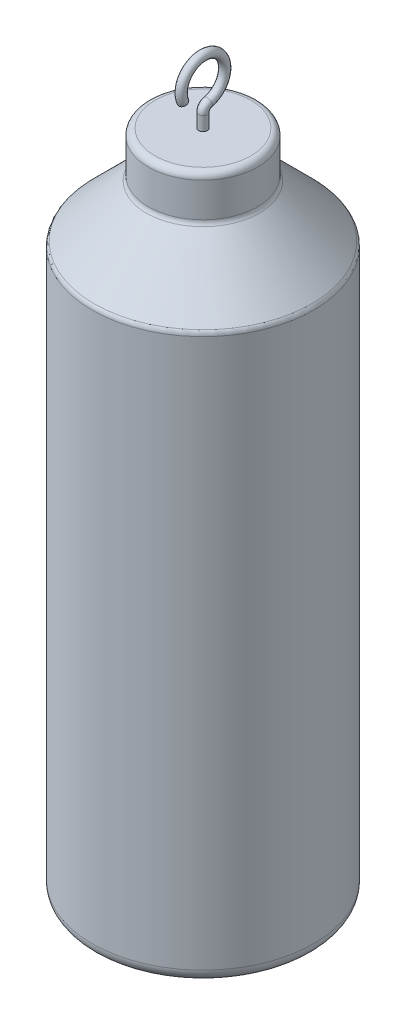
ISO-10303-21;
HEADER;
FILE_DESCRIPTION(('STEP AP214'),'2;1');
FILE_NAME('part.step','',(''),(''),'','','');
FILE_SCHEMA(('AUTOMOTIVE_DESIGN { 1 0 10303 214 1 1 1 1 }'));
ENDSEC;
DATA;
#1=APPLICATION_CONTEXT('core data for automotive mechanical design processes');
#2=APPLICATION_PROTOCOL_DEFINITION('international standard','automotive_design',2000,#1);
#3=PRODUCT_CONTEXT('',#1,'mechanical');
#4=PRODUCT('Part','Part','',(#3));
#5=PRODUCT_RELATED_PRODUCT_CATEGORY('part','',(#4));
#6=PRODUCT_DEFINITION_FORMATION('','',#4);
#7=PRODUCT_DEFINITION_CONTEXT('part definition',#1,'design');
#8=PRODUCT_DEFINITION('design','',#6,#7);
#9=PRODUCT_DEFINITION_SHAPE('','',#8);
#10=(LENGTH_UNIT() NAMED_UNIT(*) SI_UNIT(.MILLI.,.METRE.));
#11=(NAMED_UNIT(*) PLANE_ANGLE_UNIT() SI_UNIT($,.RADIAN.));
#12=(NAMED_UNIT(*) SI_UNIT($,.STERADIAN.) SOLID_ANGLE_UNIT());
#13=UNCERTAINTY_MEASURE_WITH_UNIT(LENGTH_MEASURE(1.E-05),#10,'distance_accuracy_value','');
#14=(GEOMETRIC_REPRESENTATION_CONTEXT(3) GLOBAL_UNCERTAINTY_ASSIGNED_CONTEXT((#13)) GLOBAL_UNIT_ASSIGNED_CONTEXT((#10,
#11,#12)) REPRESENTATION_CONTEXT('',''));
#15=CARTESIAN_POINT('',(0.,0.,0.));
#16=DIRECTION('',(0.,0.,1.));
#17=DIRECTION('',(1.,0.,0.));
#18=AXIS2_PLACEMENT_3D('',#15,#16,#17);
#19=CARTESIAN_POINT('',(0.,161.9,0.));
#20=DIRECTION('',(1.,0.,0.));
#21=DIRECTION('',(0.,0.,-1.));
#22=AXIS2_PLACEMENT_3D('',#19,#20,#21);
#23=TOROIDAL_SURFACE('',#22,5.00000000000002,1.);
#24=CARTESIAN_POINT('',(0.,160.349359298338,3.6872094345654));
#25=CARTESIAN_POINT('',(0.53458281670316,160.349461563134,3.68698649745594));
#26=CARTESIAN_POINT('',(1.00013574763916,160.15570760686,4.11026851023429));
#27=CARTESIAN_POINT('',(0.999863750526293,159.708631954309,5.08115373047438));
#28=CARTESIAN_POINT('',(0.535620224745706,159.513014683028,5.50443066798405));
#29=CARTESIAN_POINT('',(-0.536340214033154,159.51276723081,5.5049670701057));
#30=CARTESIAN_POINT('',(-1.00014296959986,159.70830748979,5.08185716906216));
#31=CARTESIAN_POINT('',(-0.999857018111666,160.155346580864,4.11105395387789));
#32=CARTESIAN_POINT('',(-0.534582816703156,160.349257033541,3.68743237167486));
#33=CARTESIAN_POINT('',(0.,160.349359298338,3.6872094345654));
#34=B_SPLINE_CURVE_WITH_KNOTS('',3,(#24,#25,#26,#27,#28,#29,#30,#31,#32,#33),.UNSPECIFIED.,.T.,
.F.,(4,2,2,2,4),(8.83731340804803E-05,0.00141256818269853,0.00273676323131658,
0.00406095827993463,0.00538515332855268),.UNSPECIFIED.);
#35=CARTESIAN_POINT('',(0.,160.349359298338,3.6872094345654));
#36=VERTEX_POINT('',#35);
#37=EDGE_CURVE('E11',#36,#36,#34,.F.);
#38=ORIENTED_EDGE('',*,*,#37,.T.);
#39=EDGE_LOOP('',(#38));
#40=FACE_BOUND('',#39,.T.);
#41=CARTESIAN_POINT('',(0.,157.034957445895,-1.15384615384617));
#42=DIRECTION('',(0.,0.230769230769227,-0.973008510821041));
#43=DIRECTION('',(0.,0.973008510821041,0.230769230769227));
#44=AXIS2_PLACEMENT_3D('',#41,#42,#43);
#45=CIRCLE('',#44,1.);
#46=CARTESIAN_POINT('',(0.,158.007965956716,-0.923076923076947));
#47=VERTEX_POINT('',#46);
#48=EDGE_CURVE('E68',#47,#47,#45,.T.);
#49=ORIENTED_EDGE('',*,*,#48,.T.);
#50=EDGE_LOOP('',(#49));
#51=FACE_BOUND('',#50,.T.);
#52=ADVANCED_FACE('F41',(#40,#51),#23,.T.);
#53=CARTESIAN_POINT('',(0.,155.575444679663,-1.5));
#54=DIRECTION('',(-1.,0.,0.));
#55=DIRECTION('',(0.,0.,1.));
#56=AXIS2_PLACEMENT_3D('',#53,#54,#55);
#57=TOROIDAL_SURFACE('',#56,1.5,1.);
#58=CARTESIAN_POINT('',(0.,155.575444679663,0.));
#59=DIRECTION('',(0.,1.,0.));
#60=DIRECTION('',(0.,0.,1.));
#61=AXIS2_PLACEMENT_3D('',#58,#59,#60);
#62=CIRCLE('',#61,1.);
#63=CARTESIAN_POINT('',(0.,155.575444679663,1.));
#64=VERTEX_POINT('',#63);
#65=EDGE_CURVE('E129',#64,#64,#62,.T.);
#66=CARTESIAN_POINT('',(0.,155.575444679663,-1.5));
#67=DIRECTION('',(-1.,0.,0.));
#68=DIRECTION('',(0.,0.,1.));
#69=AXIS2_PLACEMENT_3D('',#66,#67,#68);
#70=CIRCLE('',#69,2.5);
#71=EDGE_CURVE('',#64,#47,#70,.T.);
#72=ORIENTED_EDGE('',*,*,#65,.T.);
#73=ORIENTED_EDGE('',*,*,#48,.F.);
#74=ORIENTED_EDGE('',*,*,#71,.T.);
#75=ORIENTED_EDGE('',*,*,#71,.F.);
#76=EDGE_LOOP('',(#72,#74,#73,#75));
#77=FACE_BOUND('',#76,.T.);
#78=ADVANCED_FACE('F92',(#77),#57,.T.);
#79=CARTESIAN_POINT('',(0.,155.575444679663,0.));
#80=DIRECTION('',(0.,-1.,0.));
#81=DIRECTION('',(0.,0.,-1.));
#82=AXIS2_PLACEMENT_3D('',#79,#80,#81);
#83=CYLINDRICAL_SURFACE('',#82,1.);
#84=CARTESIAN_POINT('',(0.,122.55,0.));
#85=DIRECTION('',(0.,1.,0.));
#86=DIRECTION('',(0.,0.,1.));
#87=AXIS2_PLACEMENT_3D('',#84,#85,#86);
#88=CIRCLE('',#87,1.);
#89=CARTESIAN_POINT('',(0.,122.55,1.));
#90=VERTEX_POINT('',#89);
#91=EDGE_CURVE('E63',#90,#90,#88,.T.);
#92=ORIENTED_EDGE('',*,*,#91,.T.);
#93=EDGE_LOOP('',(#92));
#94=FACE_BOUND('',#93,.T.);
#95=ORIENTED_EDGE('',*,*,#65,.F.);
#96=EDGE_LOOP('',(#95));
#97=FACE_BOUND('',#96,.T.);
#98=ADVANCED_FACE('F86',(#94,#97),#83,.T.);
#99=CARTESIAN_POINT('',(0.,159.786908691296,4.53153893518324));
#100=DIRECTION('',(0.,-0.906307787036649,-0.422618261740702));
#101=DIRECTION('',(0.,0.422618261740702,-0.906307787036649));
#102=AXIS2_PLACEMENT_3D('',#99,#100,#101);
#103=PLANE('',#102);
#104=CARTESIAN_POINT('',(0.,160.146134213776,3.76117731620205));
#105=CARTESIAN_POINT('',(-0.0140956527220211,160.146131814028,3.76118246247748));
#106=CARTESIAN_POINT('',(-0.028190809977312,160.145967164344,3.761535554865));
#107=CARTESIAN_POINT('',(-0.0562455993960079,160.145318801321,3.76292597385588));
#108=CARTESIAN_POINT('',(-0.0702055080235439,160.144837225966,3.76395871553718));
#109=CARTESIAN_POINT('',(-0.0979689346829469,160.143563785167,3.76668961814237));
#110=CARTESIAN_POINT('',(-0.11177289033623,160.142773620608,3.76838413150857));
#111=CARTESIAN_POINT('',(-0.139203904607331,160.140892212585,3.77241882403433));
#112=CARTESIAN_POINT('',(-0.152831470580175,160.139802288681,3.7747561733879));
#113=CARTESIAN_POINT('',(-0.179889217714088,160.137330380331,3.78005719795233));
#114=CARTESIAN_POINT('',(-0.193319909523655,160.135949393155,3.78301873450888));
#115=CARTESIAN_POINT('',(-0.219963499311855,160.132904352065,3.78954884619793));
#116=CARTESIAN_POINT('',(-0.233176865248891,160.131241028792,3.79311585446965));
#117=CARTESIAN_POINT('',(-0.259365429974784,160.127640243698,3.80083776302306));
#118=CARTESIAN_POINT('',(-0.272341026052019,160.125703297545,3.80499155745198));
#119=CARTESIAN_POINT('',(-0.298033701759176,160.121564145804,3.81386799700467));
#120=CARTESIAN_POINT('',(-0.310751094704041,160.119362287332,3.81858989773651));
#121=CARTESIAN_POINT('',(-0.335907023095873,160.114702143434,3.82858360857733));
#122=CARTESIAN_POINT('',(-0.34834578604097,160.112244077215,3.8338549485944));
#123=CARTESIAN_POINT('',(-0.372924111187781,160.107080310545,3.84492868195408));
#124=CARTESIAN_POINT('',(-0.385063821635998,160.104374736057,3.85073080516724));
#125=CARTESIAN_POINT('',(-0.409023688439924,160.098724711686,3.86284732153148));
#126=CARTESIAN_POINT('',(-0.420843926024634,160.0957803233,3.86916158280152));
#127=CARTESIAN_POINT('',(-0.444144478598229,160.089661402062,3.88228365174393));
#128=CARTESIAN_POINT('',(-0.45562482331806,160.086486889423,3.88909141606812));
#129=CARTESIAN_POINT('',(-0.478225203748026,160.079916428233,3.9031818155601));
#130=CARTESIAN_POINT('',(-0.489345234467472,160.076520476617,3.91046445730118));
#131=CARTESIAN_POINT('',(-0.511204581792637,160.069515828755,3.92548597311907));
#132=CARTESIAN_POINT('',(-0.521943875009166,160.065907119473,3.93322487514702));
#133=CARTESIAN_POINT('',(-0.543021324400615,160.058485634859,3.94914030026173));
#134=CARTESIAN_POINT('',(-0.553359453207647,160.054672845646,3.9573168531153));
#135=CARTESIAN_POINT('',(-0.573614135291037,160.046851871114,3.97408898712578));
#136=CARTESIAN_POINT('',(-0.583530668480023,160.042843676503,3.9826845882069));
#137=CARTESIAN_POINT('',(-0.602921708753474,160.034640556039,4.00027623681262));
#138=CARTESIAN_POINT('',(-0.612396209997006,160.030445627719,4.00927228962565));
#139=CARTESIAN_POINT('',(-0.63088272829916,160.021877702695,4.02764626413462));
#140=CARTESIAN_POINT('',(-0.639894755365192,160.017504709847,4.03702417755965));
#141=CARTESIAN_POINT('',(-0.657435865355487,160.008589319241,4.05614329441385));
#142=CARTESIAN_POINT('',(-0.665964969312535,160.004046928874,4.06588448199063));
#143=CARTESIAN_POINT('',(-0.682519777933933,159.994801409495,4.0857115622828));
#144=CARTESIAN_POINT('',(-0.690545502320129,159.990098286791,4.09579744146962));
#145=CARTESIAN_POINT('',(-0.706073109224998,159.980539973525,4.11629531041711));
#146=CARTESIAN_POINT('',(-0.713574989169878,159.975684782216,4.1267073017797));
#147=CARTESIAN_POINT('',(-0.728034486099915,159.965831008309,4.1478387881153));
#148=CARTESIAN_POINT('',(-0.734992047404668,159.960832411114,4.15855831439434));
#149=CARTESIAN_POINT('',(-0.74834251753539,159.950700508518,4.18028624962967));
#150=CARTESIAN_POINT('',(-0.754735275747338,159.945567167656,4.19129473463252));
#151=CARTESIAN_POINT('',(-0.766935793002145,159.935174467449,4.21358195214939));
#152=CARTESIAN_POINT('',(-0.772743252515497,159.929915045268,4.2248608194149));
#153=CARTESIAN_POINT('',(-0.78375288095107,159.919278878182,4.2476701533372));
#154=CARTESIAN_POINT('',(-0.788954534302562,159.913902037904,4.25920082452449));
#155=CARTESIAN_POINT('',(-0.798732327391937,159.903039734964,4.28249510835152));
#156=CARTESIAN_POINT('',(-0.803307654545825,159.89755414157,4.29425900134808));
#157=CARTESIAN_POINT('',(-0.811812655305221,159.886483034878,4.31800106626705));
#158=CARTESIAN_POINT('',(-0.815741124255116,159.88089735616,4.32997959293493));
#159=CARTESIAN_POINT('',(-0.822932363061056,159.869634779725,4.35413226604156));
#160=CARTESIAN_POINT('',(-0.826193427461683,159.863957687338,4.36630682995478));
#161=CARTESIAN_POINT('',(-0.832029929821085,159.852520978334,4.39083293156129));
#162=CARTESIAN_POINT('',(-0.834603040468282,159.846761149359,4.40318492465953));
#163=CARTESIAN_POINT('',(-0.839043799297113,159.835167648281,4.42804726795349));
#164=CARTESIAN_POINT('',(-0.840908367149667,159.829333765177,4.44055807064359));
#165=CARTESIAN_POINT('',(-0.843912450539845,159.817600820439,4.46571945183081));
#166=CARTESIAN_POINT('',(-0.845047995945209,159.811701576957,4.47837042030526));
#167=CARTESIAN_POINT('',(-0.846574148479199,159.799846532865,4.50379364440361));
#168=CARTESIAN_POINT('',(-0.846959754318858,159.79389061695,4.51656614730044));
#169=CARTESIAN_POINT('',(-0.846967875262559,159.781978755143,4.54211121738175));
#170=CARTESIAN_POINT('',(-0.846590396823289,159.776022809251,4.55488378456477));
#171=CARTESIAN_POINT('',(-0.845082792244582,159.764167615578,4.58030732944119));
#172=CARTESIAN_POINT('',(-0.843957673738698,159.758268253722,4.59295855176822));
#173=CARTESIAN_POINT('',(-0.840975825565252,159.746535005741,4.61812058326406));
#174=CARTESIAN_POINT('',(-0.839123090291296,159.740700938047,4.63063178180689));
#175=CARTESIAN_POINT('',(-0.834707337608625,159.729107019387,4.65549502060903));
#176=CARTESIAN_POINT('',(-0.832147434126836,159.723346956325,4.66784751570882));
#177=CARTESIAN_POINT('',(-0.826338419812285,159.711909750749,4.69237468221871));
#178=CARTESIAN_POINT('',(-0.823091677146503,159.706232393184,4.70454981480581));
#179=CARTESIAN_POINT('',(-0.815929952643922,159.694969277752,4.72870364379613));
#180=CARTESIAN_POINT('',(-0.812016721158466,159.689383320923,4.74068276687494));
#181=CARTESIAN_POINT('',(-0.803542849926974,159.678311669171,4.76442600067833));
#182=CARTESIAN_POINT('',(-0.798983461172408,159.672825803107,4.77619047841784));
#183=CARTESIAN_POINT('',(-0.789237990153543,159.661962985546,4.79948586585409));
#184=CARTESIAN_POINT('',(-0.784052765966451,159.656585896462,4.81101707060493));
#185=CARTESIAN_POINT('',(-0.773076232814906,159.645949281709,4.83382736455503));
#186=CARTESIAN_POINT('',(-0.767285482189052,159.640689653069,4.84510667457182));
#187=CARTESIAN_POINT('',(-0.755118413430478,159.630296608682,4.86739463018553));
#188=CARTESIAN_POINT('',(-0.748742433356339,159.625163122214,4.87840342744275));
#189=CARTESIAN_POINT('',(-0.73542534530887,159.615031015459,4.90013180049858));
#190=CARTESIAN_POINT('',(-0.728484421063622,159.610032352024,4.91085146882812));
#191=CARTESIAN_POINT('',(-0.714057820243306,159.600178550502,4.93198301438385));
#192=CARTESIAN_POINT('',(-0.706572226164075,159.595323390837,4.94239493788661));
#193=CARTESIAN_POINT('',(-0.691076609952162,159.585765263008,4.96289240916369));
#194=CARTESIAN_POINT('',(-0.683066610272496,159.581062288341,4.97297797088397));
#195=CARTESIAN_POINT('',(-0.666542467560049,159.57181720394,4.99280411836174));
#196=CARTESIAN_POINT('',(-0.65802831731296,159.56727509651,5.00254469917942));
#197=CARTESIAN_POINT('',(-0.640516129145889,159.558360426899,5.02166226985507));
#198=CARTESIAN_POINT('',(-0.631518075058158,159.553987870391,5.03103924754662));
#199=CARTESIAN_POINT('',(-0.613058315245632,159.545420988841,5.04941098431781));
#200=CARTESIAN_POINT('',(-0.603596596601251,159.541226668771,5.05840573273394));
#201=CARTESIAN_POINT('',(-0.584229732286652,159.533024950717,5.0759943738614));
#202=CARTESIAN_POINT('',(-0.574324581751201,159.529017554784,5.08458826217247));
#203=CARTESIAN_POINT('',(-0.554091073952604,159.521198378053,5.10135654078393));
#204=CARTESIAN_POINT('',(-0.543762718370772,159.517386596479,5.10953093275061));
#205=CARTESIAN_POINT('',(-0.522703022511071,159.50996734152,5.12544157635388));
#206=CARTESIAN_POINT('',(-0.511971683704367,159.506359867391,5.1331778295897));
#207=CARTESIAN_POINT('',(-0.490126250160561,159.499357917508,5.14819355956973));
#208=CARTESIAN_POINT('',(-0.479012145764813,159.495963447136,5.15547302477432));
#209=CARTESIAN_POINT('',(-0.456421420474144,159.489396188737,5.16955655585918));
#210=CARTESIAN_POINT('',(-0.444944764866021,159.486223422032,5.17636057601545));
#211=CARTESIAN_POINT('',(-0.421649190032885,159.480108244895,5.189474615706));
#212=CARTESIAN_POINT('',(-0.409830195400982,159.477165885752,5.19578452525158));
#213=CARTESIAN_POINT('',(-0.385870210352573,159.471520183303,5.20789177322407));
#214=CARTESIAN_POINT('',(-0.373729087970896,159.468816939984,5.21368889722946));
#215=CARTESIAN_POINT('',(-0.349145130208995,159.463658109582,5.22475204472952));
#216=CARTESIAN_POINT('',(-0.336702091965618,159.461202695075,5.23001769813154));
#217=CARTESIAN_POINT('',(-0.311534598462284,159.456548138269,5.23999942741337));
#218=CARTESIAN_POINT('',(-0.298809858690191,159.454349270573,5.24471491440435));
#219=CARTESIAN_POINT('',(-0.273099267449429,159.450216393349,5.25357789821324));
#220=CARTESIAN_POINT('',(-0.260113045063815,159.448282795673,5.25772451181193));
#221=CARTESIAN_POINT('',(-0.233899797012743,159.444689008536,5.26543141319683));
#222=CARTESIAN_POINT('',(-0.220672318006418,159.443029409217,5.26899043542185));
#223=CARTESIAN_POINT('',(-0.193996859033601,159.439992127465,5.27550390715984));
#224=CARTESIAN_POINT('',(-0.180548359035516,159.438615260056,5.27845660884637));
#225=CARTESIAN_POINT('',(-0.153451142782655,159.436151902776,5.28373929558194));
#226=CARTESIAN_POINT('',(-0.139801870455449,159.435066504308,5.28606694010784));
#227=CARTESIAN_POINT('',(-0.112323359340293,159.433194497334,5.29008147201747));
#228=CARTESIAN_POINT('',(-0.0984935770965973,159.432409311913,5.29176530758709));
#229=CARTESIAN_POINT('',(-0.0706742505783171,159.431146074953,5.29447432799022));
#230=CARTESIAN_POINT('',(-0.0566842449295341,159.430669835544,5.29549562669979));
#231=CARTESIAN_POINT('',(-0.0285645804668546,159.430032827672,5.29686169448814));
#232=CARTESIAN_POINT('',(-0.0144346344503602,159.429874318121,5.29720161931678));
#233=CARTESIAN_POINT('',(0.0138256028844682,159.429880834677,5.29718764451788));
#234=CARTESIAN_POINT('',(0.0279558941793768,159.430045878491,5.29683370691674));
#235=CARTESIAN_POINT('',(0.056076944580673,159.430695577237,5.29544042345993));
#236=CARTESIAN_POINT('',(0.0700679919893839,159.431178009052,5.29440584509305));
#237=CARTESIAN_POINT('',(0.0978900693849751,159.432453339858,5.29167088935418));
#238=CARTESIAN_POINT('',(0.111721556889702,159.433244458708,5.28997432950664));
#239=CARTESIAN_POINT('',(0.139204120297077,159.435128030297,5.2859349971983));
#240=CARTESIAN_POINT('',(0.152855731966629,159.436219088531,5.28359521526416));
#241=CARTESIAN_POINT('',(0.179958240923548,159.438693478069,5.27828886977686));
#242=CARTESIAN_POINT('',(0.193409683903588,159.440075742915,5.27532459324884));
#243=CARTESIAN_POINT('',(0.22009161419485,159.443123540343,5.26878857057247));
#244=CARTESIAN_POINT('',(0.233322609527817,159.444788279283,5.26521852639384));
#245=CARTESIAN_POINT('',(0.259543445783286,159.448392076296,5.25749015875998));
#246=CARTESIAN_POINT('',(0.272533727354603,159.450330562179,5.25333306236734));
#247=CARTESIAN_POINT('',(0.298252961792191,159.454472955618,5.24444967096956));
#248=CARTESIAN_POINT('',(0.310982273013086,159.456676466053,5.2397242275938));
#249=CARTESIAN_POINT('',(0.336159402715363,159.461340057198,5.2297231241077));
#250=CARTESIAN_POINT('',(0.348607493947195,159.463799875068,5.22444802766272));
#251=CARTESIAN_POINT('',(0.373202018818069,159.468967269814,5.21336651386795));
#252=CARTESIAN_POINT('',(0.385348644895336,159.471674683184,5.20756044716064));
#253=CARTESIAN_POINT('',(0.409320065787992,159.477328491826,5.19543581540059));
#254=CARTESIAN_POINT('',(0.421144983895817,159.480274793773,5.18911745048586));
#255=CARTESIAN_POINT('',(0.444452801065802,159.486397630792,5.17598698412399));
#256=CARTESIAN_POINT('',(0.455935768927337,159.489574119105,5.16917498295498));
#257=CARTESIAN_POINT('',(0.478539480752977,159.4961486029,5.1550759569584));
#258=CARTESIAN_POINT('',(0.489660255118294,159.499546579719,5.14778897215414));
#259=CARTESIAN_POINT('',(0.51151935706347,159.50655533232,5.13275865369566));
#260=CARTESIAN_POINT('',(0.522257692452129,159.510166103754,5.12501532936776));
#261=CARTESIAN_POINT('',(0.543331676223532,159.517591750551,5.10909097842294));
#262=CARTESIAN_POINT('',(0.553667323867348,159.521406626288,5.1009099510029));
#263=CARTESIAN_POINT('',(0.573915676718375,159.52923179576,5.08412882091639));
#264=CARTESIAN_POINT('',(0.583828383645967,159.533242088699,5.07552871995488));
#265=CARTESIAN_POINT('',(0.603210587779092,159.541449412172,5.05792805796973));
#266=CARTESIAN_POINT('',(0.612680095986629,159.545646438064,5.04892750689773));
#267=CARTESIAN_POINT('',(0.631155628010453,159.554218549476,5.03054455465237));
#268=CARTESIAN_POINT('',(0.640161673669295,159.558593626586,5.02116217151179));
#269=CARTESIAN_POINT('',(0.657690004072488,159.567513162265,5.00203416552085));
#270=CARTESIAN_POINT('',(0.666212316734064,159.572057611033,4.99228856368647));
#271=CARTESIAN_POINT('',(0.682752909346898,159.581307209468,4.97245273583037));
#272=CARTESIAN_POINT('',(0.690771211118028,159.586012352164,4.96236252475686));
#273=CARTESIAN_POINT('',(0.706283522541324,159.595574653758,4.9418561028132));
#274=CARTESIAN_POINT('',(0.713777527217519,159.600431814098,4.9314398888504));
#275=CARTESIAN_POINT('',(0.728221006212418,159.61028946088,4.91030009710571));
#276=CARTESIAN_POINT('',(0.735170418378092,159.615289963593,4.89957648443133));
#277=CARTESIAN_POINT('',(0.748504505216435,159.62542559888,4.87784054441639));
#278=CARTESIAN_POINT('',(0.754889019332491,159.630560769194,4.86682813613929));
#279=CARTESIAN_POINT('',(0.767073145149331,159.640957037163,4.84453326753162));
#280=CARTESIAN_POINT('',(0.772872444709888,159.646218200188,4.83325066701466));
#281=CARTESIAN_POINT('',(0.783866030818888,159.656857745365,4.81043408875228));
#282=CARTESIAN_POINT('',(0.789059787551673,159.662236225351,4.79889990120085));
#283=CARTESIAN_POINT('',(0.798822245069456,159.673101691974,4.77559883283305));
#284=CARTESIAN_POINT('',(0.803390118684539,159.678588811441,4.76383166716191));
#285=CARTESIAN_POINT('',(0.811880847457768,159.689662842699,4.74008333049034));
#286=CARTESIAN_POINT('',(0.815802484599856,159.695249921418,4.72810180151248));
#287=CARTESIAN_POINT('',(0.822980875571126,159.706515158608,4.70394342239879));
#288=CARTESIAN_POINT('',(0.826235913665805,159.712193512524,4.69176615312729));
#289=CARTESIAN_POINT('',(0.832061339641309,159.723632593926,4.66723496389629));
#290=CARTESIAN_POINT('',(0.834629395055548,159.729393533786,4.65488058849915));
#291=CARTESIAN_POINT('',(0.839061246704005,159.740989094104,4.63001382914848));
#292=CARTESIAN_POINT('',(0.840921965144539,159.746823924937,4.61750099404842));
#293=CARTESIAN_POINT('',(0.843919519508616,159.758558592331,4.59233591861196));
#294=CARTESIAN_POINT('',(0.845052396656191,159.764458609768,4.57968329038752));
#295=CARTESIAN_POINT('',(0.846575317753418,159.776315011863,4.55425715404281));
#296=CARTESIAN_POINT('',(0.846960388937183,159.782271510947,4.54148340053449));
#297=CARTESIAN_POINT('',(0.84696682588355,159.794184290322,4.51593636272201));
#298=CARTESIAN_POINT('',(0.846588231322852,159.800140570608,4.50316307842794));
#299=CARTESIAN_POINT('',(0.845075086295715,159.811996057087,4.47773890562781));
#300=CARTESIAN_POINT('',(0.843945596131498,159.81789537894,4.465087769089));
#301=CARTESIAN_POINT('',(0.840952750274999,159.82962819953,4.43992665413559));
#302=CARTESIAN_POINT('',(0.839093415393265,159.835461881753,4.42741628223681));
#303=CARTESIAN_POINT('',(0.834662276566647,159.847054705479,4.40255539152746));
#304=CARTESIAN_POINT('',(0.832093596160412,159.85281406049,4.39020441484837));
#305=CARTESIAN_POINT('',(0.826265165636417,159.864249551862,4.36568092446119));
#306=CARTESIAN_POINT('',(0.823007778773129,159.869925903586,4.35350794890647));
#307=CARTESIAN_POINT('',(0.815823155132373,159.881186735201,4.32935901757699));
#308=CARTESIAN_POINT('',(0.811897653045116,159.886771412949,4.31738263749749));
#309=CARTESIAN_POINT('',(0.803397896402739,159.897840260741,4.29364541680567));
#310=CARTESIAN_POINT('',(0.798824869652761,159.903324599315,4.28188421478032));
#311=CARTESIAN_POINT('',(0.789051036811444,159.914184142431,4.25859584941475));
#312=CARTESIAN_POINT('',(0.783851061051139,159.919559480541,4.24706839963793));
#313=CARTESIAN_POINT('',(0.772844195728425,159.930192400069,4.22426603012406));
#314=CARTESIAN_POINT('',(0.767037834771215,159.935450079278,4.2129909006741));
#315=CARTESIAN_POINT('',(0.754838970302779,159.945839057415,4.19071166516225));
#316=CARTESIAN_POINT('',(0.748446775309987,159.950970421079,4.17970742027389));
#317=CARTESIAN_POINT('',(0.735096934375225,159.961098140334,4.15798845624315));
#318=CARTESIAN_POINT('',(0.728139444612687,159.96609453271,4.14727365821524));
#319=CARTESIAN_POINT('',(0.713679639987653,159.975943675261,4.12615210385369));
#320=CARTESIAN_POINT('',(0.706177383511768,159.980796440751,4.1157453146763));
#321=CARTESIAN_POINT('',(0.690648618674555,159.990349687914,4.09525831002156));
#322=CARTESIAN_POINT('',(0.682622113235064,159.995050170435,4.08517809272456));
#323=CARTESIAN_POINT('',(0.666065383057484,160.004290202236,4.06536278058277));
#324=CARTESIAN_POINT('',(0.657535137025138,160.008829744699,4.05562770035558));
#325=CARTESIAN_POINT('',(0.639991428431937,160.017739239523,4.03652122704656));
#326=CARTESIAN_POINT('',(0.630977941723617,160.022109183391,4.02714985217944));
#327=CARTESIAN_POINT('',(0.612488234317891,160.0306708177,4.0087893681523));
#328=CARTESIAN_POINT('',(0.603011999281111,160.03486250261,3.99980027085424));
#329=CARTESIAN_POINT('',(0.583617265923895,160.043058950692,3.98222293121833));
#330=CARTESIAN_POINT('',(0.573698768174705,160.047063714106,3.97363468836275));
#331=CARTESIAN_POINT('',(0.553439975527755,160.054877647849,3.95687765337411));
#332=CARTESIAN_POINT('',(0.543099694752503,160.058686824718,3.94870884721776));
#333=CARTESIAN_POINT('',(0.522017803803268,160.066100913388,3.93280928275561));
#334=CARTESIAN_POINT('',(0.511276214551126,160.069705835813,3.92507850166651));
#335=CARTESIAN_POINT('',(0.489412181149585,160.076702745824,3.91007357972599));
#336=CARTESIAN_POINT('',(0.478289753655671,160.080094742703,3.90279941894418));
#337=CARTESIAN_POINT('',(0.455684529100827,160.086657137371,3.8887263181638));
#338=CARTESIAN_POINT('',(0.444201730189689,160.089827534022,3.88192738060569));
#339=CARTESIAN_POINT('',(0.420896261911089,160.095938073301,3.8688232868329));
#340=CARTESIAN_POINT('',(0.409073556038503,160.098878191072,3.86251818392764));
#341=CARTESIAN_POINT('',(0.385108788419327,160.104519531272,3.85042029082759));
#342=CARTESIAN_POINT('',(0.37296663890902,160.107220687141,3.84462764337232));
#343=CARTESIAN_POINT('',(0.348383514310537,160.11237548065,3.83357315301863));
#344=CARTESIAN_POINT('',(0.335942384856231,160.114828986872,3.82831159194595));
#345=CARTESIAN_POINT('',(0.310781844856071,160.119479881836,3.81833771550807));
#346=CARTESIAN_POINT('',(0.298062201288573,160.121677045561,3.81362588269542));
#347=CARTESIAN_POINT('',(0.272365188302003,160.12580668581,3.80476984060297));
#348=CARTESIAN_POINT('',(0.259387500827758,160.127738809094,3.80062638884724));
#349=CARTESIAN_POINT('',(0.233194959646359,160.131329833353,3.79292541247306));
#350=CARTESIAN_POINT('',(0.219979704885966,160.132988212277,3.78936900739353));
#351=CARTESIAN_POINT('',(0.193332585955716,160.136023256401,3.78286033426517));
#352=CARTESIAN_POINT('',(0.179900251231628,160.13739918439,3.77990964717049));
#353=CARTESIAN_POINT('',(0.152839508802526,160.139860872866,3.77463053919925));
#354=CARTESIAN_POINT('',(0.139210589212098,160.140945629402,3.77230427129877));
#355=CARTESIAN_POINT('',(0.11177719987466,160.142816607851,3.76829194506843));
#356=CARTESIAN_POINT('',(0.0979722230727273,160.143601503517,3.76660873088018));
#357=CARTESIAN_POINT('',(0.0702071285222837,160.144864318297,3.76390061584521));
#358=CARTESIAN_POINT('',(0.0562465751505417,160.145340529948,3.762879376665));
#359=CARTESIAN_POINT('',(0.0281909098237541,160.145978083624,3.76151213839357));
#360=CARTESIAN_POINT('',(0.0140955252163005,160.146137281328,3.76117073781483));
#361=CARTESIAN_POINT('',(0.,160.146134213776,3.76117731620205));
#362=B_SPLINE_CURVE_WITH_KNOTS('',3,(#104,#105,#106,#107,#108,#109,#110,#111,#112,#113,#114,
#115,#116,#117,#118,#119,#120,#121,#122,#123,#124,#125,#126,#127,#128,#129,#130,#131,#132,#133,
#134,#135,#136,#137,#138,#139,#140,#141,#142,#143,#144,#145,#146,#147,#148,#149,#150,#151,#152,
#153,#154,#155,#156,#157,#158,#159,#160,#161,#162,#163,#164,#165,#166,#167,#168,#169,#170,#171,
#172,#173,#174,#175,#176,#177,#178,#179,#180,#181,#182,#183,#184,#185,#186,#187,#188,#189,#190,
#191,#192,#193,#194,#195,#196,#197,#198,#199,#200,#201,#202,#203,#204,#205,#206,#207,#208,#209,
#210,#211,#212,#213,#214,#215,#216,#217,#218,#219,#220,#221,#222,#223,#224,#225,#226,#227,#228,
#229,#230,#231,#232,#233,#234,#235,#236,#237,#238,#239,#240,#241,#242,#243,#244,#245,#246,#247,
#248,#249,#250,#251,#252,#253,#254,#255,#256,#257,#258,#259,#260,#261,#262,#263,#264,#265,#266,
#267,#268,#269,#270,#271,#272,#273,#274,#275,#276,#277,#278,#279,#280,#281,#282,#283,#284,#285,
#286,#287,#288,#289,#290,#291,#292,#293,#294,#295,#296,#297,#298,#299,#300,#301,#302,#303,#304,
#305,#306,#307,#308,#309,#310,#311,#312,#313,#314,#315,#316,#317,#318,#319,#320,#321,#322,#323,
#324,#325,#326,#327,#328,#329,#330,#331,#332,#333,#334,#335,#336,#337,#338,#339,#340,#341,#342,
#343,#344,#345,#346,#347,#348,#349,#350,#351,#352,#353,#354,#355,#356,#357,#358,#359,#360,#361),
.UNSPECIFIED.,.F.,.F.,(4,2,2,2,2,2,2,2,2,2,2,2,2,2,2,2,2,2,2,2,2,2,2,2,2,2,2,2,2,2,2,2,2,2,2,2,
2,2,2,2,2,2,2,2,2,2,2,2,2,2,2,2,2,2,2,2,2,2,2,2,2,2,2,2,2,2,2,2,2,2,2,2,2,2,2,2,2,2,2,2,2,2,2,2,
2,2,2,2,2,2,2,2,2,2,2,2,2,2,2,2,2,2,2,2,2,2,2,2,2,2,2,2,2,2,2,2,2,2,2,2,2,2,2,2,2,2,2,2,4),(0.,
0.0422812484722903,0.0842801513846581,0.126050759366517,0.167640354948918,0.209089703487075,
0.250433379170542,0.29170015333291,0.332913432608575,0.374091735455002,0.415249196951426,
0.456396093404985,0.497539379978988,0.538683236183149,0.57982961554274,0.620978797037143,
0.662129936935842,0.703281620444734,0.744432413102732,0.785581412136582,0.82672879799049,
0.867876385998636,0.909028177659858,0.950190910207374,0.991374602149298,1.03259309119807,
1.0738645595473,1.11521203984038,1.15666389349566,1.19825425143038,1.24002340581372,
1.28201814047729,1.32429198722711,1.36656547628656,1.40855863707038,1.45032442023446,
1.49190914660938,1.53335276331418,1.57468917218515,1.61594661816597,1.65714812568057,
1.69831197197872,1.73945218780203,1.78057907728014,1.82169975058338,1.86281866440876,
1.90393816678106,1.9450590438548,1.98618106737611,2.02730354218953,2.06842585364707,
2.10954801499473,2.15067121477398,2.19179836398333,2.23293464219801,2.27408804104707,
2.31526990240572,2.35649544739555,2.39778429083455,2.43916093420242,2.48065522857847,
2.52230279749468,2.56414540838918,2.6062312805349,2.64861531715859,2.69100167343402,
2.73309425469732,2.77494760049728,2.81660955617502,2.85812151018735,2.89951870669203,
2.94083062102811,2.98208138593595,3.02329025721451,3.06447210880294,3.10563794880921,
3.14679544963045,3.18794948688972,3.22910268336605,3.27025595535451,3.31140905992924,
3.35256114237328,3.39371128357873,3.4348590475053,3.47600502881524,3.51715140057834,
3.55830246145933,3.5994651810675,3.64064974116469,3.68187006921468,3.72314435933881,
3.76449557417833,3.80595191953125,3.84754728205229,3.88932161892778,3.93132128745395,
3.97359930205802,4.01587512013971,4.05786889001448,4.0996344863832,4.14121902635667,
4.18266312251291,4.22400121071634,4.26526193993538,4.30646861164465,4.34763965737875,
4.3887891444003,4.42992730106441,4.47106105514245,4.51219457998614,4.55332984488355,
4.59446716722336,4.63560576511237,4.67674430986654,4.71788147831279,4.7590165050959,
4.80014973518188,4.84128317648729,4.88242105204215,4.92357035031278,4.9647413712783,
5.00594826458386,5.04720955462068,5.08854864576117,5.12999429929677,5.1715810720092,
5.21334970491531,5.25534744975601,5.29762832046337),.UNSPECIFIED.);
#363=CARTESIAN_POINT('',(0.,160.146134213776,3.76117731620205));
#364=VERTEX_POINT('',#363);
#365=EDGE_CURVE('E53',#364,#364,#362,.F.);
#366=ORIENTED_EDGE('',*,*,#365,.T.);
#367=EDGE_LOOP('',(#366));
#368=FACE_BOUND('',#367,.T.);
#369=ADVANCED_FACE('F76',(#368),#103,.T.);
#370=CARTESIAN_POINT('',(0.,122.4,0.));
#371=DIRECTION('',(0.,1.,0.));
#372=DIRECTION('',(0.,0.,1.));
#373=AXIS2_PLACEMENT_3D('',#370,#371,#372);
#374=PLANE('',#373);
#375=CARTESIAN_POINT('',(0.,122.4,0.));
#376=DIRECTION('',(0.,1.,0.));
#377=DIRECTION('',(0.,0.,1.));
#378=AXIS2_PLACEMENT_3D('',#375,#376,#377);
#379=CIRCLE('',#378,0.84999999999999);
#380=CARTESIAN_POINT('',(0.,122.4,0.84999999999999));
#381=VERTEX_POINT('',#380);
#382=EDGE_CURVE('E58',#381,#381,#379,.F.);
#383=ORIENTED_EDGE('',*,*,#382,.T.);
#384=EDGE_LOOP('',(#383));
#385=FACE_BOUND('',#384,.T.);
#386=ADVANCED_FACE('F85',(#385),#374,.F.);
#387=CARTESIAN_POINT('',(0.,122.55,0.));
#388=DIRECTION('',(0.,1.,0.));
#389=DIRECTION('',(0.,0.,1.));
#390=AXIS2_PLACEMENT_3D('',#387,#388,#389);
#391=CONICAL_SURFACE('',#390,1.,0.785398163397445);
#392=ORIENTED_EDGE('',*,*,#382,.F.);
#393=EDGE_LOOP('',(#392));
#394=FACE_BOUND('',#393,.T.);
#395=ORIENTED_EDGE('',*,*,#91,.F.);
#396=EDGE_LOOP('',(#395));
#397=FACE_BOUND('',#396,.T.);
#398=ADVANCED_FACE('F89',(#394,#397),#391,.T.);
#399=CARTESIAN_POINT('',(0.,160.146134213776,3.76117731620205));
#400=CARTESIAN_POINT('',(0.452772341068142,160.146222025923,3.76098900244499));
#401=CARTESIAN_POINT('',(0.847078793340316,159.979552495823,4.11841296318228));
#402=CARTESIAN_POINT('',(0.846848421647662,159.596903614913,4.93900613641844));
#403=CARTESIAN_POINT('',(0.453650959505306,159.429983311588,5.29696788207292));
#404=CARTESIAN_POINT('',(-0.45426076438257,159.429771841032,5.29742138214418));
#405=CARTESIAN_POINT('',(-0.847084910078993,159.596626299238,4.93960084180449));
#406=CARTESIAN_POINT('',(-0.846842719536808,159.979243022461,4.11907663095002));
#407=CARTESIAN_POINT('',(-0.452772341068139,160.146046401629,3.7613656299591));
#408=CARTESIAN_POINT('',(0.,160.146134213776,3.76117731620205));
#409=CARTESIAN_POINT('',(0.,160.349359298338,3.6872094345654));
#410=CARTESIAN_POINT('',(0.534582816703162,160.349461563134,3.68698649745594));
#411=CARTESIAN_POINT('',(1.00013574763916,160.15570760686,4.11026851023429));
#412=CARTESIAN_POINT('',(0.999863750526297,159.708631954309,5.08115373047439));
#413=CARTESIAN_POINT('',(0.535620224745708,159.513014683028,5.50443066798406));
#414=CARTESIAN_POINT('',(-0.536340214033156,159.51276723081,5.50496707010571));
#415=CARTESIAN_POINT('',(-1.00014296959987,159.70830748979,5.08185716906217));
#416=CARTESIAN_POINT('',(-0.999857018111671,160.155346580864,4.11105395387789));
#417=CARTESIAN_POINT('',(-0.534582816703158,160.349257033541,3.68743237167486));
#418=CARTESIAN_POINT('',(0.,160.349359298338,3.6872094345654));
#419=B_SPLINE_SURFACE_WITH_KNOTS('',1,3,((#399,#400,#401,#402,#403,#404,#405,#406,#407,#408),
(#409,#410,#411,#412,#413,#414,#415,#416,#417,#418)),.UNSPECIFIED.,.F.,.T.,.F.,(2,2),(4,2,2,2,
4),(0.,1.),(8.83731340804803E-05,0.00141256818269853,0.00273676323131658,0.00406095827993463,
0.00538515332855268),.UNSPECIFIED.);
#420=ORIENTED_EDGE('',*,*,#37,.F.);
#421=EDGE_LOOP('',(#420));
#422=FACE_BOUND('',#421,.T.);
#423=ORIENTED_EDGE('',*,*,#365,.F.);
#424=EDGE_LOOP('',(#423));
#425=FACE_BOUND('',#424,.T.);
#426=ADVANCED_FACE('F43',(#422,#425),#419,.T.);
#427=CLOSED_SHELL('',(#52,#78,#98,#369,#386,#398,#426));
#428=MANIFOLD_SOLID_BREP('B2',#427);
#429=CARTESIAN_POINT('',(0.,0.,0.));
#430=DIRECTION('',(0.,1.,0.));
#431=DIRECTION('',(0.,0.,1.));
#432=AXIS2_PLACEMENT_3D('',#429,#430,#431);
#433=PLANE('',#432);
#434=CARTESIAN_POINT('',(0.,0.,0.));
#435=DIRECTION('',(0.,1.,0.));
#436=DIRECTION('',(0.,0.,1.));
#437=AXIS2_PLACEMENT_3D('',#434,#435,#436);
#438=CIRCLE('',#437,22.4);
#439=CARTESIAN_POINT('',(0.,0.,22.4));
#440=VERTEX_POINT('',#439);
#441=EDGE_CURVE('E194',#440,#440,#438,.F.);
#442=ORIENTED_EDGE('',*,*,#441,.T.);
#443=EDGE_LOOP('',(#442));
#444=FACE_BOUND('',#443,.T.);
#445=ADVANCED_FACE('F187',(#444),#433,.F.);
#446=CARTESIAN_POINT('',(0.,0.,0.));
#447=DIRECTION('',(0.,-1.,0.));
#448=DIRECTION('',(0.,0.,-1.));
#449=AXIS2_PLACEMENT_3D('',#446,#447,#448);
#450=CYLINDRICAL_SURFACE('',#449,25.4);
#451=CARTESIAN_POINT('',(0.,3.,0.));
#452=DIRECTION('',(0.,1.,0.));
#453=DIRECTION('',(0.,0.,1.));
#454=AXIS2_PLACEMENT_3D('',#451,#452,#453);
#455=CIRCLE('',#454,25.4);
#456=CARTESIAN_POINT('',(0.,3.,25.4));
#457=VERTEX_POINT('',#456);
#458=EDGE_CURVE('E39',#457,#457,#455,.T.);
#459=ORIENTED_EDGE('',*,*,#458,.T.);
#460=EDGE_LOOP('',(#459));
#461=FACE_BOUND('',#460,.T.);
#462=CARTESIAN_POINT('',(0.,128.90367965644,0.));
#463=DIRECTION('',(0.,1.,0.));
#464=DIRECTION('',(0.,0.,1.));
#465=AXIS2_PLACEMENT_3D('',#462,#463,#464);
#466=CIRCLE('',#465,25.4);
#467=CARTESIAN_POINT('',(0.,128.90367965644,25.4));
#468=VERTEX_POINT('',#467);
#469=EDGE_CURVE('E264',#468,#468,#466,.F.);
#470=ORIENTED_EDGE('',*,*,#469,.T.);
#471=EDGE_LOOP('',(#470));
#472=FACE_BOUND('',#471,.T.);
#473=ADVANCED_FACE('F215',(#461,#472),#450,.T.);
#474=CARTESIAN_POINT('',(0.,142.4,0.));
#475=DIRECTION('',(0.,-1.,0.));
#476=DIRECTION('',(0.,0.,-1.));
#477=AXIS2_PLACEMENT_3D('',#474,#475,#476);
#478=CONICAL_SURFACE('',#477,12.525,0.785398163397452);
#479=CARTESIAN_POINT('',(0.,129.96433982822,0.));
#480=DIRECTION('',(0.,1.,0.));
#481=DIRECTION('',(0.,0.,1.));
#482=AXIS2_PLACEMENT_3D('',#479,#480,#481);
#483=CIRCLE('',#482,24.9606601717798);
#484=CARTESIAN_POINT('',(0.,129.96433982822,24.9606601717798));
#485=VERTEX_POINT('',#484);
#486=EDGE_CURVE('E245',#485,#485,#483,.T.);
#487=ORIENTED_EDGE('',*,*,#486,.T.);
#488=EDGE_LOOP('',(#487));
#489=FACE_BOUND('',#488,.T.);
#490=CARTESIAN_POINT('',(0.,141.96066017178,0.));
#491=DIRECTION('',(0.,-1.,0.));
#492=DIRECTION('',(0.,0.,-1.));
#493=AXIS2_PLACEMENT_3D('',#490,#491,#492);
#494=CIRCLE('',#493,12.9643398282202);
#495=CARTESIAN_POINT('',(0.,141.96066017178,-12.9643398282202));
#496=VERTEX_POINT('',#495);
#497=EDGE_CURVE('E250',#496,#496,#494,.T.);
#498=ORIENTED_EDGE('',*,*,#497,.T.);
#499=EDGE_LOOP('',(#498));
#500=FACE_BOUND('',#499,.T.);
#501=ADVANCED_FACE('F221',(#489,#500),#478,.T.);
#502=CARTESIAN_POINT('',(0.,0.,0.));
#503=DIRECTION('',(0.,-1.,0.));
#504=DIRECTION('',(0.,0.,-1.));
#505=AXIS2_PLACEMENT_3D('',#502,#503,#504);
#506=CYLINDRICAL_SURFACE('',#505,12.525);
#507=CARTESIAN_POINT('',(0.,143.02132034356,0.));
#508=DIRECTION('',(0.,-1.,0.));
#509=DIRECTION('',(0.,0.,-1.));
#510=AXIS2_PLACEMENT_3D('',#507,#508,#509);
#511=CIRCLE('',#510,12.525);
#512=CARTESIAN_POINT('',(0.,143.02132034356,-12.525));
#513=VERTEX_POINT('',#512);
#514=EDGE_CURVE('E244',#513,#513,#511,.F.);
#515=ORIENTED_EDGE('',*,*,#514,.T.);
#516=EDGE_LOOP('',(#515));
#517=FACE_BOUND('',#516,.T.);
#518=CARTESIAN_POINT('',(0.,150.9,0.));
#519=DIRECTION('',(0.,-1.,0.));
#520=DIRECTION('',(0.,0.,-1.));
#521=AXIS2_PLACEMENT_3D('',#518,#519,#520);
#522=CIRCLE('',#521,12.525);
#523=CARTESIAN_POINT('',(0.,150.9,-12.525));
#524=VERTEX_POINT('',#523);
#525=EDGE_CURVE('E242',#524,#524,#522,.T.);
#526=ORIENTED_EDGE('',*,*,#525,.T.);
#527=EDGE_LOOP('',(#526));
#528=FACE_BOUND('',#527,.T.);
#529=ADVANCED_FACE('F259',(#517,#528),#506,.T.);
#530=CARTESIAN_POINT('',(-12.525,152.4,0.));
#531=DIRECTION('',(0.,-1.,0.));
#532=DIRECTION('',(0.,0.,-1.));
#533=AXIS2_PLACEMENT_3D('',#530,#531,#532);
#534=PLANE('',#533);
#535=CARTESIAN_POINT('',(0.,152.4,0.));
#536=DIRECTION('',(0.,-1.,0.));
#537=DIRECTION('',(0.,0.,-1.));
#538=AXIS2_PLACEMENT_3D('',#535,#536,#537);
#539=CIRCLE('',#538,11.025);
#540=CARTESIAN_POINT('',(0.,152.4,-11.025));
#541=VERTEX_POINT('',#540);
#542=EDGE_CURVE('E239',#541,#541,#539,.F.);
#543=ORIENTED_EDGE('',*,*,#542,.T.);
#544=EDGE_LOOP('',(#543));
#545=FACE_BOUND('',#544,.T.);
#546=CARTESIAN_POINT('',(0.,152.4,0.));
#547=DIRECTION('',(0.,-1.,0.));
#548=DIRECTION('',(0.,0.,-1.));
#549=AXIS2_PLACEMENT_3D('',#546,#547,#548);
#550=CIRCLE('',#549,0.999999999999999);
#551=CARTESIAN_POINT('',(0.,152.4,-0.999999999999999));
#552=VERTEX_POINT('',#551);
#553=EDGE_CURVE('E263',#552,#552,#550,.T.);
#554=ORIENTED_EDGE('',*,*,#553,.T.);
#555=EDGE_LOOP('',(#554));
#556=FACE_BOUND('',#555,.T.);
#557=ADVANCED_FACE('F210',(#545,#556),#534,.F.);
#558=CARTESIAN_POINT('',(0.,0.,0.));
#559=DIRECTION('',(0.,-1.,0.));
#560=DIRECTION('',(0.,0.,-1.));
#561=AXIS2_PLACEMENT_3D('',#558,#559,#560);
#562=CYLINDRICAL_SURFACE('',#561,0.999999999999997);
#563=ORIENTED_EDGE('',*,*,#553,.F.);
#564=EDGE_LOOP('',(#563));
#565=FACE_BOUND('',#564,.T.);
#566=CARTESIAN_POINT('',(0.,122.4,0.));
#567=DIRECTION('',(0.,-1.,0.));
#568=DIRECTION('',(0.,0.,-1.));
#569=AXIS2_PLACEMENT_3D('',#566,#567,#568);
#570=CIRCLE('',#569,0.999999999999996);
#571=CARTESIAN_POINT('',(0.,122.4,-0.999999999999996));
#572=VERTEX_POINT('',#571);
#573=EDGE_CURVE('E265',#572,#572,#570,.T.);
#574=ORIENTED_EDGE('',*,*,#573,.T.);
#575=EDGE_LOOP('',(#574));
#576=FACE_BOUND('',#575,.T.);
#577=ADVANCED_FACE('F200',(#565,#576),#562,.F.);
#578=CARTESIAN_POINT('',(0.,121.799139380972,0.));
#579=DIRECTION('',(0.,1.,0.));
#580=DIRECTION('',(0.,0.,1.));
#581=AXIS2_PLACEMENT_3D('',#578,#579,#580);
#582=CONICAL_SURFACE('',#581,0.,1.02974425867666);
#583=ORIENTED_EDGE('',*,*,#573,.F.);
#584=EDGE_LOOP('',(#583));
#585=FACE_BOUND('',#584,.T.);
#586=CARTESIAN_POINT('',(0.,121.799139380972,0.));
#587=VERTEX_POINT('',#586);
#588=VERTEX_LOOP('',#587);
#589=FACE_BOUND('',#588,.T.);
#590=ADVANCED_FACE('F197',(#585,#589),#582,.F.);
#591=CARTESIAN_POINT('',(0.,128.90367965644,0.));
#592=DIRECTION('',(0.,1.,0.));
#593=DIRECTION('',(0.,0.,1.));
#594=AXIS2_PLACEMENT_3D('',#591,#592,#593);
#595=TOROIDAL_SURFACE('',#594,23.9,1.5);
#596=ORIENTED_EDGE('',*,*,#486,.F.);
#597=EDGE_LOOP('',(#596));
#598=FACE_BOUND('',#597,.T.);
#599=ORIENTED_EDGE('',*,*,#469,.F.);
#600=EDGE_LOOP('',(#599));
#601=FACE_BOUND('',#600,.T.);
#602=ADVANCED_FACE('F199',(#598,#601),#595,.T.);
#603=CARTESIAN_POINT('',(0.,143.02132034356,0.));
#604=DIRECTION('',(0.,-1.,0.));
#605=DIRECTION('',(0.,0.,-1.));
#606=AXIS2_PLACEMENT_3D('',#603,#604,#605);
#607=TOROIDAL_SURFACE('',#606,14.025,1.5);
#608=ORIENTED_EDGE('',*,*,#514,.F.);
#609=EDGE_LOOP('',(#608));
#610=FACE_BOUND('',#609,.T.);
#611=ORIENTED_EDGE('',*,*,#497,.F.);
#612=EDGE_LOOP('',(#611));
#613=FACE_BOUND('',#612,.T.);
#614=ADVANCED_FACE('F207',(#610,#613),#607,.F.);
#615=CARTESIAN_POINT('',(0.,150.9,0.));
#616=DIRECTION('',(0.,-1.,0.));
#617=DIRECTION('',(0.,0.,-1.));
#618=AXIS2_PLACEMENT_3D('',#615,#616,#617);
#619=TOROIDAL_SURFACE('',#618,11.025,1.5);
#620=ORIENTED_EDGE('',*,*,#542,.F.);
#621=EDGE_LOOP('',(#620));
#622=FACE_BOUND('',#621,.T.);
#623=ORIENTED_EDGE('',*,*,#525,.F.);
#624=EDGE_LOOP('',(#623));
#625=FACE_BOUND('',#624,.T.);
#626=ADVANCED_FACE('F228',(#622,#625),#619,.T.);
#627=CARTESIAN_POINT('',(0.,3.,0.));
#628=DIRECTION('',(0.,1.,0.));
#629=DIRECTION('',(0.,0.,1.));
#630=AXIS2_PLACEMENT_3D('',#627,#628,#629);
#631=TOROIDAL_SURFACE('',#630,22.4,3.);
#632=ORIENTED_EDGE('',*,*,#458,.F.);
#633=EDGE_LOOP('',(#632));
#634=FACE_BOUND('',#633,.T.);
#635=ORIENTED_EDGE('',*,*,#441,.F.);
#636=EDGE_LOOP('',(#635));
#637=FACE_BOUND('',#636,.T.);
#638=ADVANCED_FACE('F189',(#634,#637),#631,.T.);
#639=CLOSED_SHELL('',(#445,#473,#501,#529,#557,#577,#590,#602,#614,#626,#638));
#640=MANIFOLD_SOLID_BREP('B6',#639);
#641=ADVANCED_BREP_SHAPE_REPRESENTATION('',(#18,#428,#640),#14);
#642=SHAPE_DEFINITION_REPRESENTATION(#9,#641);
ENDSEC;
END-ISO-10303-21;
